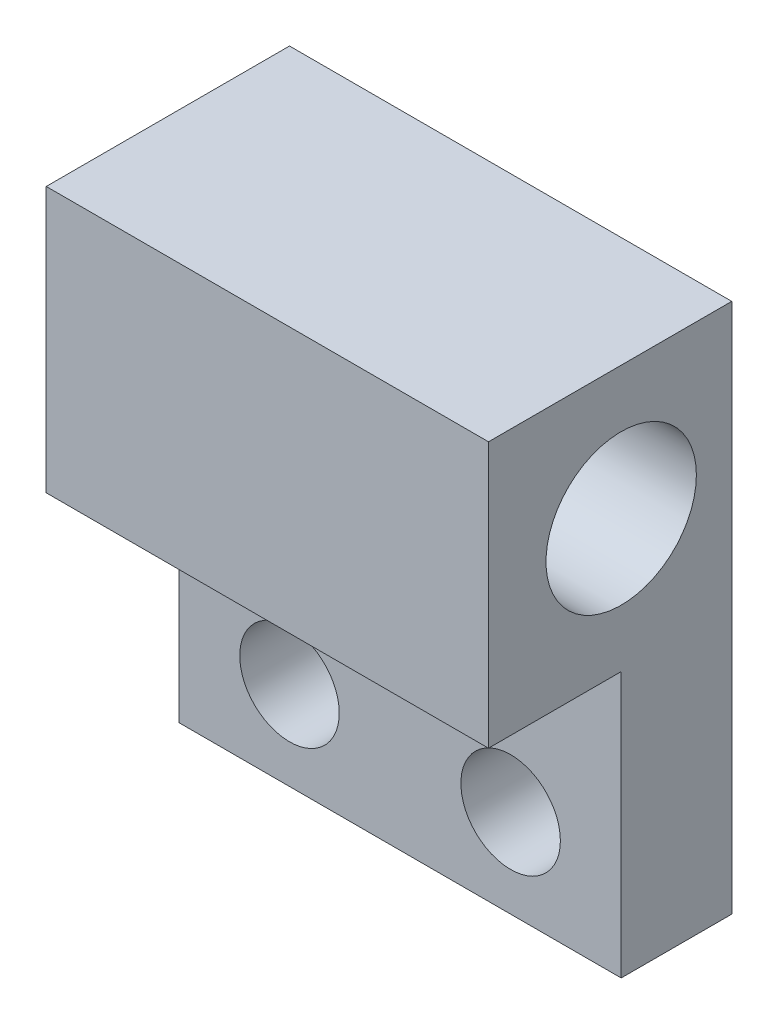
from build123d import *

# Parameters (mm, degrees)
SCHIZZO1_W                   = 20
SCHIZZO1_H                   = 12
ESTRUSIONE_ESTRUSIONE1_DEPTH = 11
SCHIZZO2_W                   = 20
SCHIZZO2_H                   = 5
ESTRUSIONE_ESTRUSIONE2_DEPTH = 12
FORO_PER_VITE_M4_1_D         = 4.5
FORO_FILETTATO_M8_1_D        = 6.8


with BuildPart() as part:
    # Schizzo1 → Estrusione-Estrusione1 (new body)
    with BuildSketch(Plane.XY):
        Rectangle(SCHIZZO1_W, SCHIZZO1_H)
    extrude(amount=ESTRUSIONE_ESTRUSIONE1_DEPTH)

    # Schizzo2 → Estrusione-Estrusione2 (add)
    with BuildSketch(Plane(origin=(0, -6, 0), x_dir=(-1, 0, 0), z_dir=(0, -1, 0))):
        with Locations((0, -2.5)):
            Rectangle(SCHIZZO2_W, SCHIZZO2_H)
    extrude(amount=ESTRUSIONE_ESTRUSIONE2_DEPTH)

    # Foro per Vite M4-1 (through all)
    with Locations(Plane.XY.offset(5)):
        with Locations((-5, -14), (5, -14)):
            Hole(FORO_PER_VITE_M4_1_D / 2)

    # Foro filettato M8-1 (through all)
    with Locations(Plane(origin=(10, 0, 0), x_dir=(0, 0, -1), z_dir=(1, 0, 0))):
        with Locations((-5, 0)):
            Hole(FORO_FILETTATO_M8_1_D / 2)


solid = part.part
